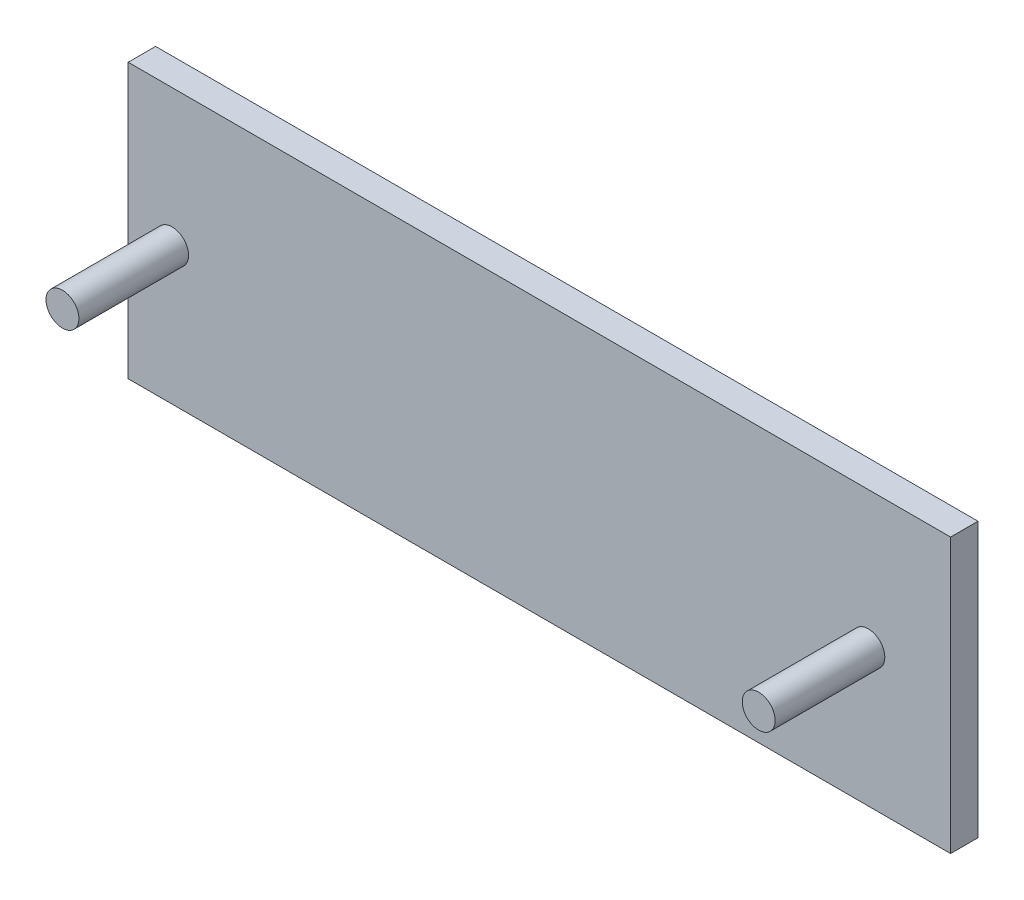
from build123d import *

# Parameters (mm, degrees)
SKIZZE1_W               = 300
SKIZZE1_H               = 100
LINEAR_AUSTRAGEN1_DEPTH = 10
SKIZZE2_R               = 6
LINEAR_AUSTRAGEN2_DEPTH = 40
SKIZZE3_R               = 6
LINEAR_AUSTRAGEN3_DEPTH = 40


with BuildPart() as part:
    # Skizze1 → Linear austragen1 (new body)
    with BuildSketch(Plane.XY):
        with Locations((150, 50)):
            Rectangle(SKIZZE1_W, SKIZZE1_H)
    extrude(amount=LINEAR_AUSTRAGEN1_DEPTH)

    # Skizze2 → Linear austragen2 (add)
    with BuildSketch(Plane.XY.offset(10)):
        with Locations(Location((16.01795377, 50, 0), (0, 0, 180))):
            Circle(SKIZZE2_R)
    extrude(amount=LINEAR_AUSTRAGEN2_DEPTH)

    # Skizze3 → Linear austragen3 (add)
    with BuildSketch(Plane.XY.offset(10)):
        with Locations(Location((270, 50, 0), (0, 0, 180))):
            Circle(SKIZZE3_R)
    extrude(amount=LINEAR_AUSTRAGEN3_DEPTH)


solid = part.part
